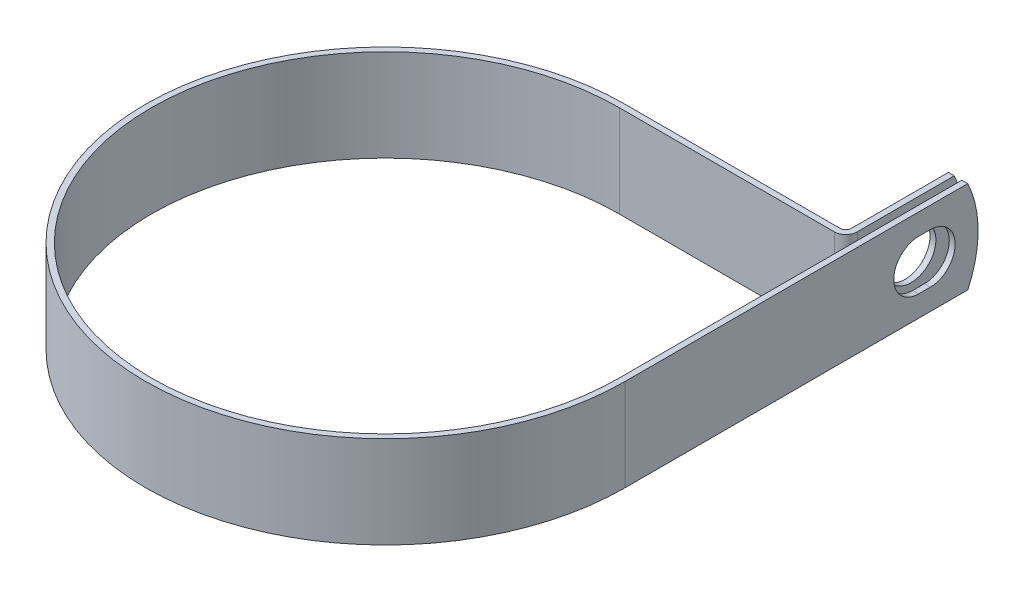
ISO-10303-21;
HEADER;
FILE_DESCRIPTION(('STEP AP214'),'2;1');
FILE_NAME('part.step','',(''),(''),'','','');
FILE_SCHEMA(('AUTOMOTIVE_DESIGN { 1 0 10303 214 1 1 1 1 }'));
ENDSEC;
DATA;
#1=APPLICATION_CONTEXT('core data for automotive mechanical design processes');
#2=APPLICATION_PROTOCOL_DEFINITION('international standard','automotive_design',2000,#1);
#3=PRODUCT_CONTEXT('',#1,'mechanical');
#4=PRODUCT('Part','Part','',(#3));
#5=PRODUCT_RELATED_PRODUCT_CATEGORY('part','',(#4));
#6=PRODUCT_DEFINITION_FORMATION('','',#4);
#7=PRODUCT_DEFINITION_CONTEXT('part definition',#1,'design');
#8=PRODUCT_DEFINITION('design','',#6,#7);
#9=PRODUCT_DEFINITION_SHAPE('','',#8);
#10=(LENGTH_UNIT() NAMED_UNIT(*) SI_UNIT(.MILLI.,.METRE.));
#11=(NAMED_UNIT(*) PLANE_ANGLE_UNIT() SI_UNIT($,.RADIAN.));
#12=(NAMED_UNIT(*) SI_UNIT($,.STERADIAN.) SOLID_ANGLE_UNIT());
#13=UNCERTAINTY_MEASURE_WITH_UNIT(LENGTH_MEASURE(1.E-05),#10,'distance_accuracy_value','');
#14=(GEOMETRIC_REPRESENTATION_CONTEXT(3) GLOBAL_UNCERTAINTY_ASSIGNED_CONTEXT((#13)) GLOBAL_UNIT_ASSIGNED_CONTEXT((#10,
#11,#12)) REPRESENTATION_CONTEXT('',''));
#15=CARTESIAN_POINT('',(0.,0.,0.));
#16=DIRECTION('',(0.,0.,1.));
#17=DIRECTION('',(1.,0.,0.));
#18=AXIS2_PLACEMENT_3D('',#15,#16,#17);
#19=CARTESIAN_POINT('',(48.4124,9.525,0.));
#20=DIRECTION('',(-1.,0.,0.));
#21=DIRECTION('',(0.,0.,1.));
#22=AXIS2_PLACEMENT_3D('',#19,#20,#21);
#23=PLANE('',#22);
#24=DIRECTION('',(0.,0.,-1.));
#25=VECTOR('',#24,1.);
#26=CARTESIAN_POINT('',(48.4124,-5.1562,-60.7059999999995));
#27=LINE('',#26,#25);
#28=CARTESIAN_POINT('',(48.4124,-5.1562,-60.7059999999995));
#29=VERTEX_POINT('',#28);
#30=CARTESIAN_POINT('',(48.4124,-5.1562,-63.0936000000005));
#31=VERTEX_POINT('',#30);
#32=EDGE_CURVE('E236',#29,#31,#27,.T.);
#33=ORIENTED_EDGE('',*,*,#32,.T.);
#34=CARTESIAN_POINT('',(48.4124,0.,-63.0935999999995));
#35=DIRECTION('',(-1.,0.,0.));
#36=DIRECTION('',(0.,0.,1.));
#37=AXIS2_PLACEMENT_3D('',#34,#35,#36);
#38=CIRCLE('',#37,5.1562);
#39=CARTESIAN_POINT('',(48.4124,5.1562,-63.0936000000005));
#40=VERTEX_POINT('',#39);
#41=EDGE_CURVE('E257',#31,#40,#38,.F.);
#42=ORIENTED_EDGE('',*,*,#41,.T.);
#43=DIRECTION('',(0.,0.,1.));
#44=VECTOR('',#43,1.);
#45=CARTESIAN_POINT('',(48.4124,5.1562,-60.7059999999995));
#46=LINE('',#45,#44);
#47=CARTESIAN_POINT('',(48.4124,5.1562,-60.7059999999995));
#48=VERTEX_POINT('',#47);
#49=EDGE_CURVE('E253',#40,#48,#46,.T.);
#50=ORIENTED_EDGE('',*,*,#49,.T.);
#51=CARTESIAN_POINT('',(48.4124,0.,-60.7059999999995));
#52=DIRECTION('',(-1.,0.,0.));
#53=DIRECTION('',(0.,0.,1.));
#54=AXIS2_PLACEMENT_3D('',#51,#52,#53);
#55=CIRCLE('',#54,5.1562);
#56=EDGE_CURVE('E248',#48,#29,#55,.F.);
#57=ORIENTED_EDGE('',*,*,#56,.T.);
#58=EDGE_LOOP('',(#33,#42,#50,#57));
#59=FACE_BOUND('',#58,.T.);
#60=CARTESIAN_POINT('',(48.4124,0.,-50.7746));
#61=DIRECTION('',(-1.,0.,0.));
#62=DIRECTION('',(0.,0.,1.));
#63=AXIS2_PLACEMENT_3D('',#60,#61,#62);
#64=CIRCLE('',#63,22.225);
#65=CARTESIAN_POINT('',(48.4124,9.525,-70.8550631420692));
#66=VERTEX_POINT('',#65);
#67=CARTESIAN_POINT('',(48.4124,-9.525,-70.8550631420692));
#68=VERTEX_POINT('',#67);
#69=EDGE_CURVE('E75',#66,#68,#64,.T.);
#70=ORIENTED_EDGE('',*,*,#69,.T.);
#71=DIRECTION('',(0.,0.,-1.));
#72=VECTOR('',#71,1.);
#73=CARTESIAN_POINT('',(48.4124,-9.525,0.));
#74=LINE('',#73,#72);
#75=CARTESIAN_POINT('',(48.4124,-9.525,0.));
#76=VERTEX_POINT('',#75);
#77=EDGE_CURVE('E271',#76,#68,#74,.T.);
#78=ORIENTED_EDGE('',*,*,#77,.F.);
#79=DIRECTION('',(0.,-1.,0.));
#80=VECTOR('',#79,1.);
#81=CARTESIAN_POINT('',(48.4124,9.525,0.));
#82=LINE('',#81,#80);
#83=CARTESIAN_POINT('',(48.4124,9.525,0.));
#84=VERTEX_POINT('',#83);
#85=EDGE_CURVE('E218',#84,#76,#82,.T.);
#86=ORIENTED_EDGE('',*,*,#85,.F.);
#87=DIRECTION('',(0.,0.,-1.));
#88=VECTOR('',#87,1.);
#89=CARTESIAN_POINT('',(48.4124,9.525,-48.4124));
#90=LINE('',#89,#88);
#91=EDGE_CURVE('E273',#84,#66,#90,.T.);
#92=ORIENTED_EDGE('',*,*,#91,.T.);
#93=EDGE_LOOP('',(#70,#78,#86,#92));
#94=FACE_BOUND('',#93,.T.);
#95=ADVANCED_FACE('F54',(#59,#94),#23,.T.);
#96=CARTESIAN_POINT('',(46.8376,9.525,-72.9996));
#97=DIRECTION('',(1.,0.,0.));
#98=DIRECTION('',(0.,0.,-1.));
#99=AXIS2_PLACEMENT_3D('',#96,#97,#98);
#100=PLANE('',#99);
#101=CARTESIAN_POINT('',(46.8376,0.,-61.8998));
#102=DIRECTION('',(1.,0.,0.));
#103=DIRECTION('',(0.,0.,-1.));
#104=AXIS2_PLACEMENT_3D('',#101,#102,#103);
#105=CIRCLE('',#104,5.1562);
#106=CARTESIAN_POINT('',(46.8376,0.,-67.056));
#107=VERTEX_POINT('',#106);
#108=EDGE_CURVE('E268',#107,#107,#105,.F.);
#109=ORIENTED_EDGE('',*,*,#108,.T.);
#110=EDGE_LOOP('',(#109));
#111=FACE_BOUND('',#110,.T.);
#112=DIRECTION('',(0.,0.,1.));
#113=VECTOR('',#112,1.);
#114=CARTESIAN_POINT('',(46.8376,-9.525,-72.9996));
#115=LINE('',#114,#113);
#116=CARTESIAN_POINT('',(46.8376,-9.525,-70.8550631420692));
#117=VERTEX_POINT('',#116);
#118=CARTESIAN_POINT('',(46.8376,-9.525,-50.78984));
#119=VERTEX_POINT('',#118);
#120=EDGE_CURVE('E184',#117,#119,#115,.T.);
#121=ORIENTED_EDGE('',*,*,#120,.F.);
#122=CARTESIAN_POINT('',(46.8376,0.,-50.7746));
#123=DIRECTION('',(1.,0.,0.));
#124=DIRECTION('',(0.,0.,-1.));
#125=AXIS2_PLACEMENT_3D('',#122,#123,#124);
#126=CIRCLE('',#125,22.225);
#127=CARTESIAN_POINT('',(46.8376,9.525,-70.8550631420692));
#128=VERTEX_POINT('',#127);
#129=EDGE_CURVE('E176',#117,#128,#126,.T.);
#130=ORIENTED_EDGE('',*,*,#129,.T.);
#131=DIRECTION('',(0.,0.,1.));
#132=VECTOR('',#131,1.);
#133=CARTESIAN_POINT('',(46.8376,9.525,-72.9996));
#134=LINE('',#133,#132);
#135=CARTESIAN_POINT('',(46.8376,9.525,-50.78984));
#136=VERTEX_POINT('',#135);
#137=EDGE_CURVE('E224',#128,#136,#134,.T.);
#138=ORIENTED_EDGE('',*,*,#137,.T.);
#139=DIRECTION('',(0.,-1.,0.));
#140=VECTOR('',#139,1.);
#141=CARTESIAN_POINT('',(46.8376,9.525,-50.78984));
#142=LINE('',#141,#140);
#143=EDGE_CURVE('E211',#136,#119,#142,.T.);
#144=ORIENTED_EDGE('',*,*,#143,.T.);
#145=EDGE_LOOP('',(#121,#130,#138,#144));
#146=FACE_BOUND('',#145,.T.);
#147=ADVANCED_FACE('F226',(#111,#146),#100,.T.);
#148=CARTESIAN_POINT('',(45.6184,9.525,-72.9996));
#149=DIRECTION('',(1.,0.,0.));
#150=DIRECTION('',(0.,0.,-1.));
#151=AXIS2_PLACEMENT_3D('',#148,#149,#150);
#152=PLANE('',#151);
#153=CARTESIAN_POINT('',(45.6184,0.,-61.8998));
#154=DIRECTION('',(-1.,0.,0.));
#155=DIRECTION('',(0.,0.,1.));
#156=AXIS2_PLACEMENT_3D('',#153,#154,#155);
#157=CIRCLE('',#156,5.1562);
#158=CARTESIAN_POINT('',(45.6184,0.,-56.7436));
#159=VERTEX_POINT('',#158);
#160=EDGE_CURVE('E265',#159,#159,#157,.T.);
#161=ORIENTED_EDGE('',*,*,#160,.F.);
#162=EDGE_LOOP('',(#161));
#163=FACE_BOUND('',#162,.T.);
#164=CARTESIAN_POINT('',(45.6184,0.,-50.7746));
#165=DIRECTION('',(-1.,0.,0.));
#166=DIRECTION('',(0.,0.,1.));
#167=AXIS2_PLACEMENT_3D('',#164,#165,#166);
#168=CIRCLE('',#167,22.225);
#169=CARTESIAN_POINT('',(45.6184,9.525,-70.8550631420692));
#170=VERTEX_POINT('',#169);
#171=CARTESIAN_POINT('',(45.6184,-9.525,-70.8550631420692));
#172=VERTEX_POINT('',#171);
#173=EDGE_CURVE('E67',#170,#172,#168,.T.);
#174=ORIENTED_EDGE('',*,*,#173,.T.);
#175=DIRECTION('',(0.,0.,1.));
#176=VECTOR('',#175,1.);
#177=CARTESIAN_POINT('',(45.6184,-9.525,-72.9996));
#178=LINE('',#177,#176);
#179=CARTESIAN_POINT('',(45.6184,-9.525,-50.78984));
#180=VERTEX_POINT('',#179);
#181=EDGE_CURVE('E167',#172,#180,#178,.T.);
#182=ORIENTED_EDGE('',*,*,#181,.T.);
#183=DIRECTION('',(0.,-1.,0.));
#184=VECTOR('',#183,1.);
#185=CARTESIAN_POINT('',(45.6184,9.525,-50.78984));
#186=LINE('',#185,#184);
#187=CARTESIAN_POINT('',(45.6184,9.525,-50.78984));
#188=VERTEX_POINT('',#187);
#189=EDGE_CURVE('E209',#188,#180,#186,.T.);
#190=ORIENTED_EDGE('',*,*,#189,.F.);
#191=DIRECTION('',(0.,0.,1.));
#192=VECTOR('',#191,1.);
#193=CARTESIAN_POINT('',(45.6184,9.525,-72.9996));
#194=LINE('',#193,#192);
#195=EDGE_CURVE('E169',#170,#188,#194,.T.);
#196=ORIENTED_EDGE('',*,*,#195,.F.);
#197=EDGE_LOOP('',(#174,#182,#190,#196));
#198=FACE_BOUND('',#197,.T.);
#199=ADVANCED_FACE('F164',(#163,#198),#152,.F.);
#200=CARTESIAN_POINT('',(49.6316,9.525,0.));
#201=DIRECTION('',(-1.,0.,0.));
#202=DIRECTION('',(0.,0.,1.));
#203=AXIS2_PLACEMENT_3D('',#200,#201,#202);
#204=PLANE('',#203);
#205=CARTESIAN_POINT('',(49.6316,0.,-63.0935999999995));
#206=DIRECTION('',(1.,0.,0.));
#207=DIRECTION('',(0.,0.,-1.));
#208=AXIS2_PLACEMENT_3D('',#205,#206,#207);
#209=CIRCLE('',#208,5.1562);
#210=CARTESIAN_POINT('',(49.6316,-5.1562,-63.0936000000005));
#211=VERTEX_POINT('',#210);
#212=CARTESIAN_POINT('',(49.6316,5.1562,-63.0936000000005));
#213=VERTEX_POINT('',#212);
#214=EDGE_CURVE('E237',#211,#213,#209,.T.);
#215=ORIENTED_EDGE('',*,*,#214,.F.);
#216=DIRECTION('',(0.,0.,-1.));
#217=VECTOR('',#216,1.);
#218=CARTESIAN_POINT('',(49.6316,-5.1562,-60.7059999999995));
#219=LINE('',#218,#217);
#220=CARTESIAN_POINT('',(49.6316,-5.1562,-60.7059999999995));
#221=VERTEX_POINT('',#220);
#222=EDGE_CURVE('E240',#221,#211,#219,.T.);
#223=ORIENTED_EDGE('',*,*,#222,.F.);
#224=CARTESIAN_POINT('',(49.6316,0.,-60.7059999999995));
#225=DIRECTION('',(1.,0.,0.));
#226=DIRECTION('',(0.,0.,-1.));
#227=AXIS2_PLACEMENT_3D('',#224,#225,#226);
#228=CIRCLE('',#227,5.1562);
#229=CARTESIAN_POINT('',(49.6316,5.1562,-60.7059999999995));
#230=VERTEX_POINT('',#229);
#231=EDGE_CURVE('E230',#230,#221,#228,.T.);
#232=ORIENTED_EDGE('',*,*,#231,.F.);
#233=DIRECTION('',(0.,0.,1.));
#234=VECTOR('',#233,1.);
#235=CARTESIAN_POINT('',(49.6316,5.1562,-60.7059999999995));
#236=LINE('',#235,#234);
#237=EDGE_CURVE('E234',#213,#230,#236,.T.);
#238=ORIENTED_EDGE('',*,*,#237,.F.);
#239=EDGE_LOOP('',(#215,#223,#232,#238));
#240=FACE_BOUND('',#239,.T.);
#241=DIRECTION('',(0.,0.,-1.));
#242=VECTOR('',#241,1.);
#243=CARTESIAN_POINT('',(49.6316,-9.525,0.));
#244=LINE('',#243,#242);
#245=CARTESIAN_POINT('',(49.6316,-9.525,0.));
#246=VERTEX_POINT('',#245);
#247=CARTESIAN_POINT('',(49.6316,-9.525,-70.8550631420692));
#248=VERTEX_POINT('',#247);
#249=EDGE_CURVE('E195',#246,#248,#244,.T.);
#250=ORIENTED_EDGE('',*,*,#249,.T.);
#251=CARTESIAN_POINT('',(49.6316,0.,-50.7746));
#252=DIRECTION('',(-1.,0.,0.));
#253=DIRECTION('',(0.,0.,1.));
#254=AXIS2_PLACEMENT_3D('',#251,#252,#253);
#255=CIRCLE('',#254,22.225);
#256=CARTESIAN_POINT('',(49.6316,9.525,-70.8550631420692));
#257=VERTEX_POINT('',#256);
#258=EDGE_CURVE('E170',#257,#248,#255,.T.);
#259=ORIENTED_EDGE('',*,*,#258,.F.);
#260=DIRECTION('',(0.,0.,-1.));
#261=VECTOR('',#260,1.);
#262=CARTESIAN_POINT('',(49.6316,9.525,-48.4124));
#263=LINE('',#262,#261);
#264=CARTESIAN_POINT('',(49.6316,9.525,0.));
#265=VERTEX_POINT('',#264);
#266=EDGE_CURVE('E198',#265,#257,#263,.T.);
#267=ORIENTED_EDGE('',*,*,#266,.F.);
#268=DIRECTION('',(0.,-1.,0.));
#269=VECTOR('',#268,1.);
#270=CARTESIAN_POINT('',(49.6316,9.525,0.));
#271=LINE('',#270,#269);
#272=EDGE_CURVE('E199',#265,#246,#271,.T.);
#273=ORIENTED_EDGE('',*,*,#272,.T.);
#274=EDGE_LOOP('',(#250,#259,#267,#273));
#275=FACE_BOUND('',#274,.T.);
#276=ADVANCED_FACE('F321',(#240,#275),#204,.F.);
#277=CARTESIAN_POINT('',(0.,-9.525,0.));
#278=DIRECTION('',(0.,1.,0.));
#279=DIRECTION('',(1.,0.,0.));
#280=AXIS2_PLACEMENT_3D('',#277,#278,#279);
#281=PLANE('',#280);
#282=DIRECTION('',(-1.,0.,0.));
#283=VECTOR('',#282,1.);
#284=CARTESIAN_POINT('',(49.6316,-9.525,-70.8550631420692));
#285=LINE('',#284,#283);
#286=EDGE_CURVE('E171',#248,#68,#285,.T.);
#287=ORIENTED_EDGE('',*,*,#286,.F.);
#288=ORIENTED_EDGE('',*,*,#249,.F.);
#289=CARTESIAN_POINT('',(0.,-9.525,0.));
#290=DIRECTION('',(0.,1.,0.));
#291=DIRECTION('',(1.,0.,0.));
#292=AXIS2_PLACEMENT_3D('',#289,#290,#291);
#293=CIRCLE('',#292,49.6316);
#294=CARTESIAN_POINT('',(0.,-9.525,-49.6316));
#295=VERTEX_POINT('',#294);
#296=EDGE_CURVE('E193',#295,#246,#293,.T.);
#297=ORIENTED_EDGE('',*,*,#296,.F.);
#298=DIRECTION('',(1.,0.,0.));
#299=VECTOR('',#298,1.);
#300=CARTESIAN_POINT('',(0.,-9.525,-49.6316));
#301=LINE('',#300,#299);
#302=CARTESIAN_POINT('',(44.46016,-9.525,-49.6316));
#303=VERTEX_POINT('',#302);
#304=EDGE_CURVE('E186',#303,#295,#301,.F.);
#305=ORIENTED_EDGE('',*,*,#304,.F.);
#306=CARTESIAN_POINT('',(44.46016,-9.525,-50.78984));
#307=DIRECTION('',(0.,1.,0.));
#308=DIRECTION('',(1.,0.,0.));
#309=AXIS2_PLACEMENT_3D('',#306,#307,#308);
#310=CIRCLE('',#309,1.15824);
#311=EDGE_CURVE('E183',#180,#303,#310,.F.);
#312=ORIENTED_EDGE('',*,*,#311,.F.);
#313=ORIENTED_EDGE('',*,*,#181,.F.);
#314=DIRECTION('',(-1.,0.,0.));
#315=VECTOR('',#314,1.);
#316=CARTESIAN_POINT('',(49.6316,-9.525,-70.8550631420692));
#317=LINE('',#316,#315);
#318=EDGE_CURVE('E12',#117,#172,#317,.T.);
#319=ORIENTED_EDGE('',*,*,#318,.F.);
#320=ORIENTED_EDGE('',*,*,#120,.T.);
#321=CARTESIAN_POINT('',(44.46016,-9.525,-50.78984));
#322=DIRECTION('',(0.,-1.,0.));
#323=DIRECTION('',(0.,0.,1.));
#324=AXIS2_PLACEMENT_3D('',#321,#322,#323);
#325=CIRCLE('',#324,2.37744);
#326=CARTESIAN_POINT('',(44.46016,-9.525,-48.4124));
#327=VERTEX_POINT('',#326);
#328=EDGE_CURVE('E188',#119,#327,#325,.T.);
#329=ORIENTED_EDGE('',*,*,#328,.T.);
#330=DIRECTION('',(-1.,0.,0.));
#331=VECTOR('',#330,1.);
#332=CARTESIAN_POINT('',(0.,-9.525,-48.4124));
#333=LINE('',#332,#331);
#334=CARTESIAN_POINT('',(0.,-9.525,-48.4124));
#335=VERTEX_POINT('',#334);
#336=EDGE_CURVE('E298',#327,#335,#333,.T.);
#337=ORIENTED_EDGE('',*,*,#336,.T.);
#338=CARTESIAN_POINT('',(0.,-9.525,0.));
#339=DIRECTION('',(0.,1.,0.));
#340=DIRECTION('',(0.,0.,1.));
#341=AXIS2_PLACEMENT_3D('',#338,#339,#340);
#342=CIRCLE('',#341,48.4124);
#343=EDGE_CURVE('E295',#335,#76,#342,.T.);
#344=ORIENTED_EDGE('',*,*,#343,.T.);
#345=ORIENTED_EDGE('',*,*,#77,.T.);
#346=EDGE_LOOP('',(#287,#288,#297,#305,#312,#313,#319,#320,#329,#337,#344,#345));
#347=FACE_BOUND('',#346,.T.);
#348=ADVANCED_FACE('F181',(#347),#281,.F.);
#349=CARTESIAN_POINT('',(0.,9.525,0.));
#350=DIRECTION('',(0.,1.,0.));
#351=DIRECTION('',(1.,0.,0.));
#352=AXIS2_PLACEMENT_3D('',#349,#350,#351);
#353=PLANE('',#352);
#354=ORIENTED_EDGE('',*,*,#266,.T.);
#355=DIRECTION('',(-1.,0.,0.));
#356=VECTOR('',#355,1.);
#357=CARTESIAN_POINT('',(49.6316,9.525,-70.8550631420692));
#358=LINE('',#357,#356);
#359=EDGE_CURVE('E228',#257,#66,#358,.T.);
#360=ORIENTED_EDGE('',*,*,#359,.T.);
#361=ORIENTED_EDGE('',*,*,#91,.F.);
#362=CARTESIAN_POINT('',(0.,9.525,0.));
#363=DIRECTION('',(0.,1.,0.));
#364=DIRECTION('',(0.,0.,1.));
#365=AXIS2_PLACEMENT_3D('',#362,#363,#364);
#366=CIRCLE('',#365,48.4124);
#367=CARTESIAN_POINT('',(0.,9.525,-48.4124));
#368=VERTEX_POINT('',#367);
#369=EDGE_CURVE('E276',#368,#84,#366,.T.);
#370=ORIENTED_EDGE('',*,*,#369,.F.);
#371=DIRECTION('',(-1.,0.,0.));
#372=VECTOR('',#371,1.);
#373=CARTESIAN_POINT('',(0.,9.525,-48.4124));
#374=LINE('',#373,#372);
#375=CARTESIAN_POINT('',(44.46016,9.525,-48.4124));
#376=VERTEX_POINT('',#375);
#377=EDGE_CURVE('E279',#376,#368,#374,.T.);
#378=ORIENTED_EDGE('',*,*,#377,.F.);
#379=CARTESIAN_POINT('',(44.46016,9.525,-50.78984));
#380=DIRECTION('',(0.,-1.,0.));
#381=DIRECTION('',(0.,0.,1.));
#382=AXIS2_PLACEMENT_3D('',#379,#380,#381);
#383=CIRCLE('',#382,2.37744);
#384=EDGE_CURVE('E282',#136,#376,#383,.T.);
#385=ORIENTED_EDGE('',*,*,#384,.F.);
#386=ORIENTED_EDGE('',*,*,#137,.F.);
#387=DIRECTION('',(-1.,0.,0.));
#388=VECTOR('',#387,1.);
#389=CARTESIAN_POINT('',(49.6316,9.525,-70.8550631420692));
#390=LINE('',#389,#388);
#391=EDGE_CURVE('E61',#128,#170,#390,.T.);
#392=ORIENTED_EDGE('',*,*,#391,.T.);
#393=ORIENTED_EDGE('',*,*,#195,.T.);
#394=CARTESIAN_POINT('',(44.46016,9.525,-50.78984));
#395=DIRECTION('',(0.,1.,0.));
#396=DIRECTION('',(1.,0.,0.));
#397=AXIS2_PLACEMENT_3D('',#394,#395,#396);
#398=CIRCLE('',#397,1.15824);
#399=CARTESIAN_POINT('',(44.46016,9.525,-49.6316));
#400=VERTEX_POINT('',#399);
#401=EDGE_CURVE('E287',#188,#400,#398,.F.);
#402=ORIENTED_EDGE('',*,*,#401,.T.);
#403=DIRECTION('',(1.,0.,0.));
#404=VECTOR('',#403,1.);
#405=CARTESIAN_POINT('',(0.,9.525,-49.6316));
#406=LINE('',#405,#404);
#407=CARTESIAN_POINT('',(0.,9.525,-49.6316));
#408=VERTEX_POINT('',#407);
#409=EDGE_CURVE('E289',#400,#408,#406,.F.);
#410=ORIENTED_EDGE('',*,*,#409,.T.);
#411=CARTESIAN_POINT('',(0.,9.525,0.));
#412=DIRECTION('',(0.,1.,0.));
#413=DIRECTION('',(1.,0.,0.));
#414=AXIS2_PLACEMENT_3D('',#411,#412,#413);
#415=CIRCLE('',#414,49.6316);
#416=EDGE_CURVE('E203',#408,#265,#415,.T.);
#417=ORIENTED_EDGE('',*,*,#416,.T.);
#418=EDGE_LOOP('',(#354,#360,#361,#370,#378,#385,#386,#392,#393,#402,#410,#417));
#419=FACE_BOUND('',#418,.T.);
#420=ADVANCED_FACE('F222',(#419),#353,.T.);
#421=CARTESIAN_POINT('',(0.,9.525,0.));
#422=DIRECTION('',(0.,-1.,0.));
#423=DIRECTION('',(0.,0.,-1.));
#424=AXIS2_PLACEMENT_3D('',#421,#422,#423);
#425=CYLINDRICAL_SURFACE('',#424,48.4124);
#426=ORIENTED_EDGE('',*,*,#343,.F.);
#427=DIRECTION('',(0.,-1.,0.));
#428=VECTOR('',#427,1.);
#429=CARTESIAN_POINT('',(0.,9.525,-48.4124));
#430=LINE('',#429,#428);
#431=EDGE_CURVE('E216',#368,#335,#430,.T.);
#432=ORIENTED_EDGE('',*,*,#431,.F.);
#433=ORIENTED_EDGE('',*,*,#369,.T.);
#434=ORIENTED_EDGE('',*,*,#85,.T.);
#435=EDGE_LOOP('',(#426,#432,#433,#434));
#436=FACE_BOUND('',#435,.T.);
#437=ADVANCED_FACE('F311',(#436),#425,.F.);
#438=CARTESIAN_POINT('',(0.,9.525,-48.4124));
#439=DIRECTION('',(0.,0.,1.));
#440=DIRECTION('',(1.,0.,0.));
#441=AXIS2_PLACEMENT_3D('',#438,#439,#440);
#442=PLANE('',#441);
#443=ORIENTED_EDGE('',*,*,#336,.F.);
#444=DIRECTION('',(0.,-1.,0.));
#445=VECTOR('',#444,1.);
#446=CARTESIAN_POINT('',(44.46016,9.525,-48.4124));
#447=LINE('',#446,#445);
#448=EDGE_CURVE('E214',#376,#327,#447,.T.);
#449=ORIENTED_EDGE('',*,*,#448,.F.);
#450=ORIENTED_EDGE('',*,*,#377,.T.);
#451=ORIENTED_EDGE('',*,*,#431,.T.);
#452=EDGE_LOOP('',(#443,#449,#450,#451));
#453=FACE_BOUND('',#452,.T.);
#454=ADVANCED_FACE('F307',(#453),#442,.T.);
#455=CARTESIAN_POINT('',(44.46016,9.525,-50.78984));
#456=DIRECTION('',(0.,-1.,0.));
#457=DIRECTION('',(0.,0.,-1.));
#458=AXIS2_PLACEMENT_3D('',#455,#456,#457);
#459=CYLINDRICAL_SURFACE('',#458,2.37744);
#460=ORIENTED_EDGE('',*,*,#328,.F.);
#461=ORIENTED_EDGE('',*,*,#143,.F.);
#462=ORIENTED_EDGE('',*,*,#384,.T.);
#463=ORIENTED_EDGE('',*,*,#448,.T.);
#464=EDGE_LOOP('',(#460,#461,#462,#463));
#465=FACE_BOUND('',#464,.T.);
#466=ADVANCED_FACE('F304',(#465),#459,.T.);
#467=CARTESIAN_POINT('',(44.46016,9.525,-50.78984));
#468=DIRECTION('',(0.,-1.,0.));
#469=DIRECTION('',(0.,0.,-1.));
#470=AXIS2_PLACEMENT_3D('',#467,#468,#469);
#471=CYLINDRICAL_SURFACE('',#470,1.15824);
#472=ORIENTED_EDGE('',*,*,#311,.T.);
#473=DIRECTION('',(0.,-1.,0.));
#474=VECTOR('',#473,1.);
#475=CARTESIAN_POINT('',(44.46016,9.525,-49.6316));
#476=LINE('',#475,#474);
#477=EDGE_CURVE('E206',#400,#303,#476,.T.);
#478=ORIENTED_EDGE('',*,*,#477,.F.);
#479=ORIENTED_EDGE('',*,*,#401,.F.);
#480=ORIENTED_EDGE('',*,*,#189,.T.);
#481=EDGE_LOOP('',(#472,#478,#479,#480));
#482=FACE_BOUND('',#481,.T.);
#483=ADVANCED_FACE('F334',(#482),#471,.F.);
#484=CARTESIAN_POINT('',(0.,9.525,-49.6316));
#485=DIRECTION('',(0.,0.,1.));
#486=DIRECTION('',(1.,0.,0.));
#487=AXIS2_PLACEMENT_3D('',#484,#485,#486);
#488=PLANE('',#487);
#489=ORIENTED_EDGE('',*,*,#304,.T.);
#490=DIRECTION('',(0.,-1.,0.));
#491=VECTOR('',#490,1.);
#492=CARTESIAN_POINT('',(0.,9.525,-49.6316));
#493=LINE('',#492,#491);
#494=EDGE_CURVE('E202',#408,#295,#493,.T.);
#495=ORIENTED_EDGE('',*,*,#494,.F.);
#496=ORIENTED_EDGE('',*,*,#409,.F.);
#497=ORIENTED_EDGE('',*,*,#477,.T.);
#498=EDGE_LOOP('',(#489,#495,#496,#497));
#499=FACE_BOUND('',#498,.T.);
#500=ADVANCED_FACE('F330',(#499),#488,.F.);
#501=CARTESIAN_POINT('',(0.,9.525,0.));
#502=DIRECTION('',(0.,-1.,0.));
#503=DIRECTION('',(0.,0.,-1.));
#504=AXIS2_PLACEMENT_3D('',#501,#502,#503);
#505=CYLINDRICAL_SURFACE('',#504,49.6316);
#506=ORIENTED_EDGE('',*,*,#296,.T.);
#507=ORIENTED_EDGE('',*,*,#272,.F.);
#508=ORIENTED_EDGE('',*,*,#416,.F.);
#509=ORIENTED_EDGE('',*,*,#494,.T.);
#510=EDGE_LOOP('',(#506,#507,#508,#509));
#511=FACE_BOUND('',#510,.T.);
#512=ADVANCED_FACE('F327',(#511),#505,.T.);
#513=CARTESIAN_POINT('',(61.4215359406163,0.,-61.8998));
#514=DIRECTION('',(-1.,0.,0.));
#515=DIRECTION('',(0.,0.,1.));
#516=AXIS2_PLACEMENT_3D('',#513,#514,#515);
#517=CYLINDRICAL_SURFACE('',#516,5.1562);
#518=ORIENTED_EDGE('',*,*,#160,.T.);
#519=EDGE_LOOP('',(#518));
#520=FACE_BOUND('',#519,.T.);
#521=ORIENTED_EDGE('',*,*,#108,.F.);
#522=EDGE_LOOP('',(#521));
#523=FACE_BOUND('',#522,.T.);
#524=ADVANCED_FACE('F379',(#520,#523),#517,.F.);
#525=CARTESIAN_POINT('',(32.05282806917,-5.1562,-60.7059999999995));
#526=DIRECTION('',(0.,-1.,0.));
#527=DIRECTION('',(0.,0.,-1.));
#528=AXIS2_PLACEMENT_3D('',#525,#526,#527);
#529=PLANE('',#528);
#530=DIRECTION('',(1.,0.,0.));
#531=VECTOR('',#530,1.);
#532=CARTESIAN_POINT('',(32.05282806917,-5.1562,-60.7059999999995));
#533=LINE('',#532,#531);
#534=EDGE_CURVE('E251',#29,#221,#533,.T.);
#535=ORIENTED_EDGE('',*,*,#534,.T.);
#536=ORIENTED_EDGE('',*,*,#222,.T.);
#537=DIRECTION('',(1.,0.,0.));
#538=VECTOR('',#537,1.);
#539=CARTESIAN_POINT('',(32.05282806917,-5.1562,-63.0936000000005));
#540=LINE('',#539,#538);
#541=EDGE_CURVE('E247',#31,#211,#540,.T.);
#542=ORIENTED_EDGE('',*,*,#541,.F.);
#543=ORIENTED_EDGE('',*,*,#32,.F.);
#544=EDGE_LOOP('',(#535,#536,#542,#543));
#545=FACE_BOUND('',#544,.T.);
#546=ADVANCED_FACE('F354',(#545),#529,.F.);
#547=CARTESIAN_POINT('',(32.05282806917,0.,-63.0935999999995));
#548=DIRECTION('',(1.,0.,0.));
#549=DIRECTION('',(0.,0.,-1.));
#550=AXIS2_PLACEMENT_3D('',#547,#548,#549);
#551=CYLINDRICAL_SURFACE('',#550,5.1562);
#552=ORIENTED_EDGE('',*,*,#541,.T.);
#553=ORIENTED_EDGE('',*,*,#214,.T.);
#554=DIRECTION('',(1.,0.,0.));
#555=VECTOR('',#554,1.);
#556=CARTESIAN_POINT('',(32.05282806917,5.1562,-63.0936000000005));
#557=LINE('',#556,#555);
#558=EDGE_CURVE('E256',#40,#213,#557,.T.);
#559=ORIENTED_EDGE('',*,*,#558,.F.);
#560=ORIENTED_EDGE('',*,*,#41,.F.);
#561=EDGE_LOOP('',(#552,#553,#559,#560));
#562=FACE_BOUND('',#561,.T.);
#563=ADVANCED_FACE('F358',(#562),#551,.F.);
#564=CARTESIAN_POINT('',(32.05282806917,5.1562,-60.7059999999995));
#565=DIRECTION('',(0.,1.,0.));
#566=DIRECTION('',(0.,0.,1.));
#567=AXIS2_PLACEMENT_3D('',#564,#565,#566);
#568=PLANE('',#567);
#569=ORIENTED_EDGE('',*,*,#558,.T.);
#570=ORIENTED_EDGE('',*,*,#237,.T.);
#571=DIRECTION('',(1.,0.,0.));
#572=VECTOR('',#571,1.);
#573=CARTESIAN_POINT('',(32.05282806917,5.1562,-60.7059999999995));
#574=LINE('',#573,#572);
#575=EDGE_CURVE('E252',#48,#230,#574,.T.);
#576=ORIENTED_EDGE('',*,*,#575,.F.);
#577=ORIENTED_EDGE('',*,*,#49,.F.);
#578=EDGE_LOOP('',(#569,#570,#576,#577));
#579=FACE_BOUND('',#578,.T.);
#580=ADVANCED_FACE('F362',(#579),#568,.F.);
#581=CARTESIAN_POINT('',(32.05282806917,0.,-60.7059999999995));
#582=DIRECTION('',(1.,0.,0.));
#583=DIRECTION('',(0.,0.,-1.));
#584=AXIS2_PLACEMENT_3D('',#581,#582,#583);
#585=CYLINDRICAL_SURFACE('',#584,5.1562);
#586=ORIENTED_EDGE('',*,*,#575,.T.);
#587=ORIENTED_EDGE('',*,*,#231,.T.);
#588=ORIENTED_EDGE('',*,*,#534,.F.);
#589=ORIENTED_EDGE('',*,*,#56,.F.);
#590=EDGE_LOOP('',(#586,#587,#588,#589));
#591=FACE_BOUND('',#590,.T.);
#592=ADVANCED_FACE('F366',(#591),#585,.F.);
#593=CARTESIAN_POINT('',(49.6316,0.,-50.7746));
#594=DIRECTION('',(-1.,0.,0.));
#595=DIRECTION('',(0.,0.,1.));
#596=AXIS2_PLACEMENT_3D('',#593,#594,#595);
#597=CYLINDRICAL_SURFACE('',#596,22.225);
#598=ORIENTED_EDGE('',*,*,#129,.F.);
#599=ORIENTED_EDGE('',*,*,#318,.T.);
#600=ORIENTED_EDGE('',*,*,#173,.F.);
#601=ORIENTED_EDGE('',*,*,#391,.F.);
#602=EDGE_LOOP('',(#598,#599,#600,#601));
#603=FACE_BOUND('',#602,.T.);
#604=ADVANCED_FACE('F174',(#603),#597,.T.);
#605=ORIENTED_EDGE('',*,*,#359,.F.);
#606=ORIENTED_EDGE('',*,*,#258,.T.);
#607=ORIENTED_EDGE('',*,*,#286,.T.);
#608=ORIENTED_EDGE('',*,*,#69,.F.);
#609=EDGE_LOOP('',(#605,#606,#607,#608));
#610=FACE_BOUND('',#609,.T.);
#611=ADVANCED_FACE('F316',(#610),#597,.T.);
#612=CLOSED_SHELL('',(#95,#147,#199,#276,#348,#420,#437,#454,#466,#483,#500,#512,#524,#546,#563,
#580,#592,#604,#611));
#613=MANIFOLD_SOLID_BREP('B2',#612);
#614=ADVANCED_BREP_SHAPE_REPRESENTATION('',(#18,#613),#14);
#615=SHAPE_DEFINITION_REPRESENTATION(#9,#614);
ENDSEC;
END-ISO-10303-21;
